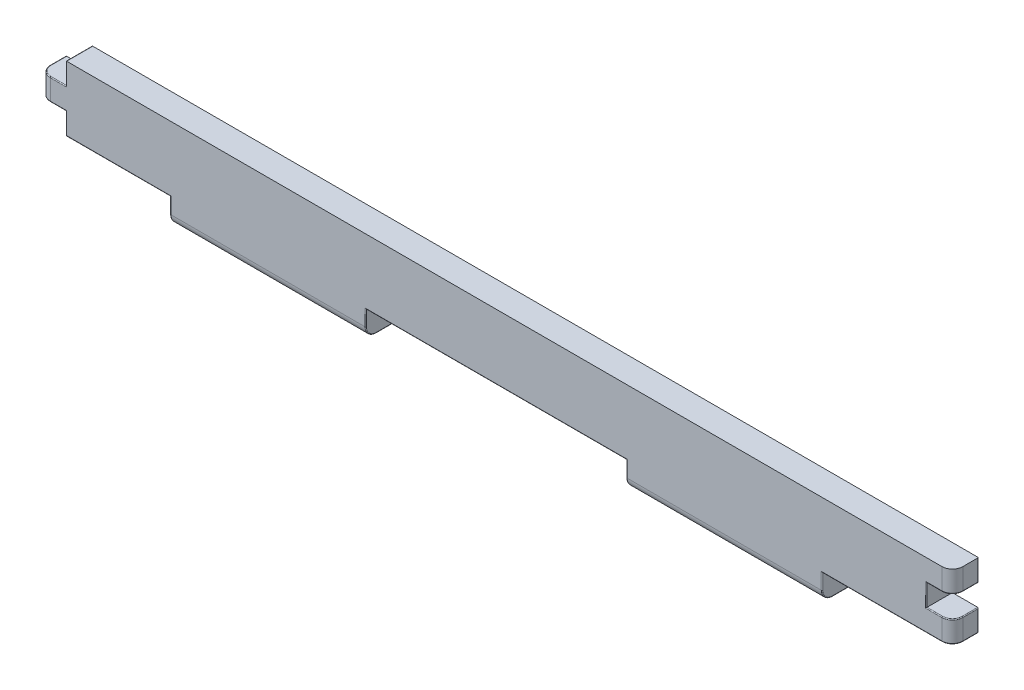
from build123d import *

# Parameters (mm, degrees)
SKETCH1_W           = 350
SKETCH1_H           = 35
BOSS_EXTRUDE1_DEPTH = 10
SKETCH2_W           = 10
SKETCH2_H           = 8.333333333
SKETCH2_W_2         = 100
SKETCH2_H_2         = 10
SKETCH2_W_3         = 50
SKETCH2_H_3         = 8.33
CUT_EXTRUDE1_DEPTH  = 177.1568903
FILLET1_R           = 4
FILLET2_R           = 0.3


with BuildPart() as part:
    # Sketch1 → Boss-Extrude1 (new body)
    with BuildSketch(Plane.XY):
        Rectangle(SKETCH1_W, SKETCH1_H)
    extrude(amount=BOSS_EXTRUDE1_DEPTH)

    # Sketch2 → Cut-Extrude1 (cut, through all)
    with BuildSketch(Plane.XY.offset(10)):
        Polygon((-165, 0.833333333), (-175, 0.833333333), (-175, -17.5), (-125, -17.5), (-125, -7.5), (-165, -7.5), align=None)
        with Locations((-170, 13.333333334)):
            Rectangle(SKETCH2_W, SKETCH2_H)
        with Locations((0, -12.5)):
            Rectangle(SKETCH2_W_2, SKETCH2_H_2)
        with Locations((150, -12.5)):
            Rectangle(SKETCH2_W_3, SKETCH2_H_2)
        with Locations((170, 5.005)):
            Rectangle(SKETCH2_W, SKETCH2_H_3)
    extrude(amount=-CUT_EXTRUDE1_DEPTH, mode=Mode.SUBTRACT)

    # Fillet1
    fillet1_edges = [part.edges().sort_by_distance(p)[0] for p in [
        (87.5, -17.5, 10),
        (-87.5, -17.5, 10),
        (175, -3.33, 10),
        (175, 13.335, 10),
        (-175, 5, 10),
    ]]
    fillet(fillet1_edges, radius=FILLET1_R)

    # Fillet2
    fillet2_edges = [part.edges().sort_by_distance(p)[0] for p in [
        (168, 0.84, 10),
        (168, 9.17, 10),
        (125, -16.328427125, 8.828427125),
        (-125, -16.328427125, 8.828427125),
        (-50, -16.328427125, 8.828427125),
        (173.828427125, 0.84, 8.828427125),
        (173.828427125, -7.5, 8.828427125),
        (173.828427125, 9.17, 8.828427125),
        (-173.828427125, 9.166666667, 8.828427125),
        (-173.828427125, 0.833333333, 8.828427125),
        (-168, 9.166666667, 10),
        (-175, 9.166666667, 3),
        (-165, 13.333333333, 10),
        (-165, 17.5, 5),
        (175, -3.33, 0),
        (175, 13.335, 0),
        (-175, 5, 0),
        (-175, 0.833333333, 3),
        (-145, -7.5, 10),
        (-125, -17.5, 3),
        (-165, -3.333333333, 10),
        (-168, 0.833333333, 10),
        (50, -17.5, 3),
        (-50, -17.5, 3),
        (0, -7.5, 10),
        (148, -7.5, 10),
        (175, -7.5, 3),
        (125, -17.5, 3),
        (165, 5.005, 10),
        (175, 9.17, 3),
        (175, 0.84, 3),
        (50, -10.5, 10),
        (50, -16.328427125, 8.828427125),
        (-125, -10.5, 10),
        (-50, -10.5, 10),
        (125, -10.5, 10),
    ]]
    fillet(fillet2_edges, radius=FILLET2_R)


solid = part.part
